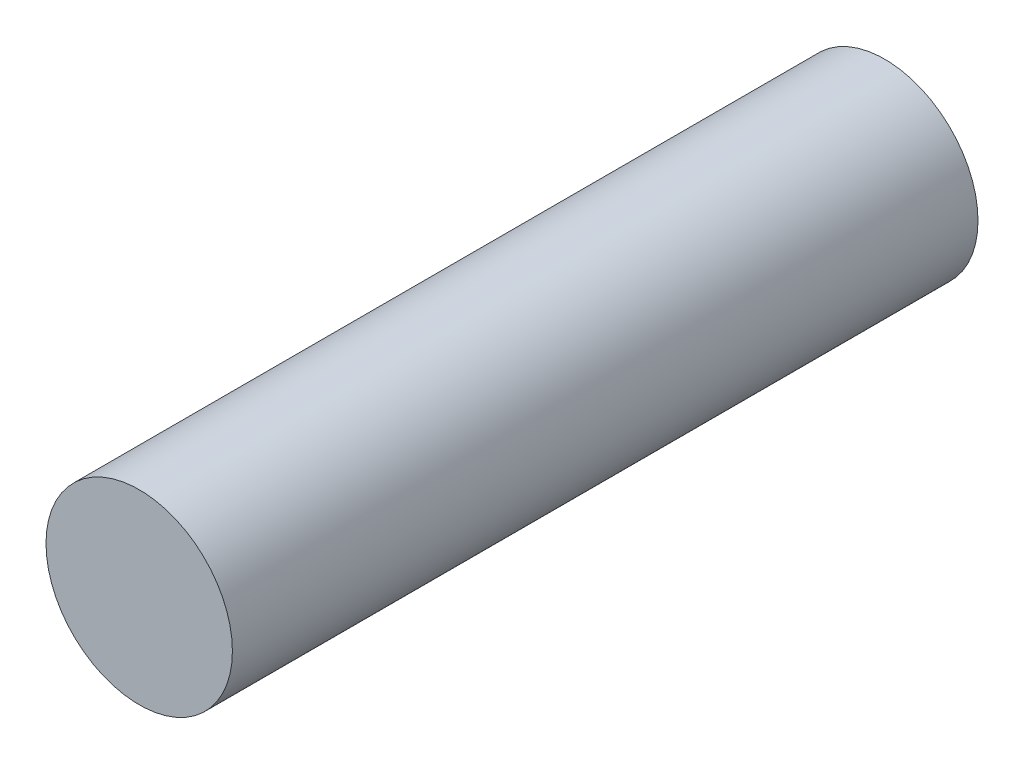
from build123d import *

# Parameters (mm, degrees)
SKETCH1_R           = 3.175
BOSS_EXTRUDE1_DEPTH = 12.7


with BuildPart() as part:
    # Sketch1 → Boss-Extrude1 (new, symmetric)
    with BuildSketch(Plane.XY):
        Circle(SKETCH1_R)
    extrude(amount=BOSS_EXTRUDE1_DEPTH, both=True)


solid = part.part
